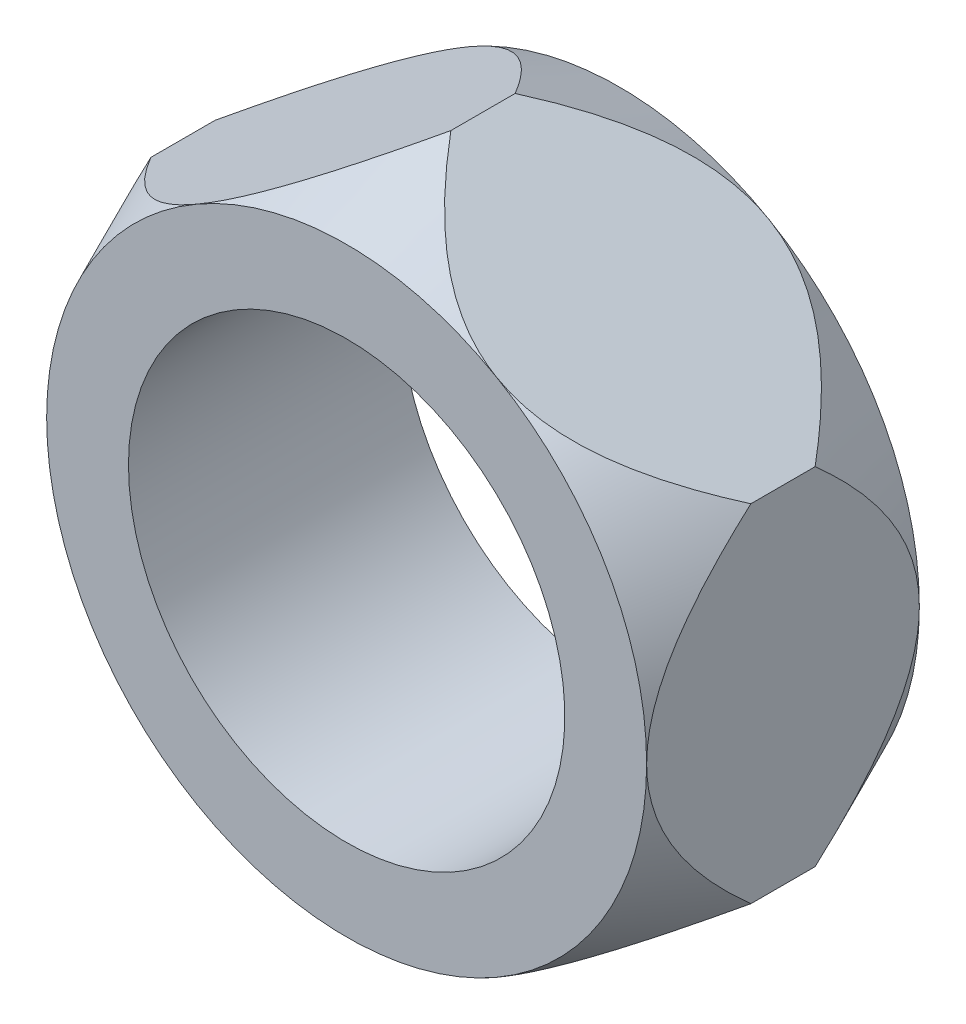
ISO-10303-21;
HEADER;
FILE_DESCRIPTION(('STEP AP214'),'2;1');
FILE_NAME('part.step','',(''),(''),'','','');
FILE_SCHEMA(('AUTOMOTIVE_DESIGN { 1 0 10303 214 1 1 1 1 }'));
ENDSEC;
DATA;
#1=APPLICATION_CONTEXT('core data for automotive mechanical design processes');
#2=APPLICATION_PROTOCOL_DEFINITION('international standard','automotive_design',2000,#1);
#3=PRODUCT_CONTEXT('',#1,'mechanical');
#4=PRODUCT('Part','Part','',(#3));
#5=PRODUCT_RELATED_PRODUCT_CATEGORY('part','',(#4));
#6=PRODUCT_DEFINITION_FORMATION('','',#4);
#7=PRODUCT_DEFINITION_CONTEXT('part definition',#1,'design');
#8=PRODUCT_DEFINITION('design','',#6,#7);
#9=PRODUCT_DEFINITION_SHAPE('','',#8);
#10=(LENGTH_UNIT() NAMED_UNIT(*) SI_UNIT(.MILLI.,.METRE.));
#11=(NAMED_UNIT(*) PLANE_ANGLE_UNIT() SI_UNIT($,.RADIAN.));
#12=(NAMED_UNIT(*) SI_UNIT($,.STERADIAN.) SOLID_ANGLE_UNIT());
#13=UNCERTAINTY_MEASURE_WITH_UNIT(LENGTH_MEASURE(1.E-05),#10,'distance_accuracy_value','');
#14=(GEOMETRIC_REPRESENTATION_CONTEXT(3) GLOBAL_UNCERTAINTY_ASSIGNED_CONTEXT((#13)) GLOBAL_UNIT_ASSIGNED_CONTEXT((#10,
#11,#12)) REPRESENTATION_CONTEXT('',''));
#15=CARTESIAN_POINT('',(0.,0.,0.));
#16=DIRECTION('',(0.,0.,1.));
#17=DIRECTION('',(1.,0.,0.));
#18=AXIS2_PLACEMENT_3D('',#15,#16,#17);
#19=CARTESIAN_POINT('',(2.75,1.58771324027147,2.5));
#20=DIRECTION('',(-0.5,-0.866025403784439,0.));
#21=DIRECTION('',(0.866025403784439,-0.5,0.));
#22=AXIS2_PLACEMENT_3D('',#19,#20,#21);
#23=PLANE('',#22);
#24=DIRECTION('',(0.,0.,-1.));
#25=VECTOR('',#24,1.);
#26=CARTESIAN_POINT('',(0.,3.17542648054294,2.5));
#27=LINE('',#26,#25);
#28=CARTESIAN_POINT('',(0.,3.17542648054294,1.54447648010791));
#29=VERTEX_POINT('',#28);
#30=CARTESIAN_POINT('',(0.,3.17542648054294,0.955523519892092));
#31=VERTEX_POINT('',#30);
#32=EDGE_CURVE('E275',#29,#31,#27,.T.);
#33=ORIENTED_EDGE('',*,*,#32,.F.);
#34=CARTESIAN_POINT('',(-0.0002,3.17554195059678,1.54421711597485));
#35=CARTESIAN_POINT('',(0.0266212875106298,3.1600566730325,1.57899726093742));
#36=CARTESIAN_POINT('',(0.0537667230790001,3.14438424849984,1.61344361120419));
#37=CARTESIAN_POINT('',(0.108791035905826,3.11261594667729,1.68156409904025));
#38=CARTESIAN_POINT('',(0.136670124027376,3.09651994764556,1.71523800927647));
#39=CARTESIAN_POINT('',(0.22191580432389,3.04730333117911,1.81538834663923));
#40=CARTESIAN_POINT('',(0.280510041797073,3.01347393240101,1.88049328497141));
#41=CARTESIAN_POINT('',(0.403820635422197,2.94228052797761,2.00785169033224));
#42=CARTESIAN_POINT('',(0.468680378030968,2.90483373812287,2.06992228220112));
#43=CARTESIAN_POINT('',(0.603403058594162,2.82705156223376,2.18600189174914));
#44=CARTESIAN_POINT('',(0.673249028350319,2.78672597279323,2.24003648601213));
#45=CARTESIAN_POINT('',(0.806569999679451,2.70975307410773,2.32831230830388));
#46=CARTESIAN_POINT('',(0.869132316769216,2.67363270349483,2.36435483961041));
#47=CARTESIAN_POINT('',(0.997832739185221,2.59932747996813,2.42515389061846));
#48=CARTESIAN_POINT('',(1.06394123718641,2.56115972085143,2.44999128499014));
#49=CARTESIAN_POINT('',(1.2000689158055,2.48256636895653,2.48587433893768));
#50=CARTESIAN_POINT('',(1.27013170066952,2.44211560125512,2.49670889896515));
#51=CARTESIAN_POINT('',(1.41078193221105,2.36091115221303,2.50199175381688));
#52=CARTESIAN_POINT('',(1.48136960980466,2.32015733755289,2.49643235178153));
#53=CARTESIAN_POINT('',(1.61084145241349,2.2454067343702,2.4717475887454));
#54=CARTESIAN_POINT('',(1.67001897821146,2.21124057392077,2.45455526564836));
#55=CARTESIAN_POINT('',(1.78562521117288,2.1444952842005,2.41061958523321));
#56=CARTESIAN_POINT('',(1.84205183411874,2.11191735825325,2.38386911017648));
#57=CARTESIAN_POINT('',(1.99746131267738,2.02219165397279,2.29762156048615));
#58=CARTESIAN_POINT('',(2.09276180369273,1.96716988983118,2.22940335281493));
#59=CARTESIAN_POINT('',(2.27427778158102,1.86237159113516,2.07812935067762));
#60=CARTESIAN_POINT('',(2.36044188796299,1.81262472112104,1.99499606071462));
#61=CARTESIAN_POINT('',(2.4972367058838,1.73364619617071,1.84980094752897));
#62=CARTESIAN_POINT('',(2.54993025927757,1.70322355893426,1.79027383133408));
#63=CARTESIAN_POINT('',(2.65214532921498,1.64420966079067,1.66889001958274));
#64=CARTESIAN_POINT('',(2.7016942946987,1.61560255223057,1.60706426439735));
#65=CARTESIAN_POINT('',(2.7502,1.58759777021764,1.54421711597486));
#66=B_SPLINE_CURVE_WITH_KNOTS('',3,(#34,#35,#36,#37,#38,#39,#40,#41,#42,#43,#44,#45,#46,#47,#48,
#49,#50,#51,#52,#53,#54,#55,#56,#57,#58,#59,#60,#61,#62,#63,#64,#65),.UNSPECIFIED.,.F.,.F.,(4,2,
2,2,2,2,2,2,2,2,2,2,2,2,2,4),(0.,0.139706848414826,0.279454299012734,0.560944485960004,
0.85241248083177,1.14293198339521,1.38444638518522,1.62418858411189,1.86750440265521,
2.11093447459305,2.32149642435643,2.5322155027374,2.91837299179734,3.30659825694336,
3.56186037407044,3.8144481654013),.UNSPECIFIED.);
#67=CARTESIAN_POINT('',(1.375,2.38156986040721,2.5));
#68=VERTEX_POINT('',#67);
#69=EDGE_CURVE('E338',#29,#68,#66,.T.);
#70=ORIENTED_EDGE('',*,*,#69,.T.);
#71=CARTESIAN_POINT('',(2.75,1.58771324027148,1.5444764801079));
#72=VERTEX_POINT('',#71);
#73=EDGE_CURVE('E139',#68,#72,#66,.T.);
#74=ORIENTED_EDGE('',*,*,#73,.T.);
#75=DIRECTION('',(0.,0.,-1.));
#76=VECTOR('',#75,1.);
#77=CARTESIAN_POINT('',(2.75,1.58771324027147,2.5));
#78=LINE('',#77,#76);
#79=CARTESIAN_POINT('',(2.75,1.58771324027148,0.955523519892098));
#80=VERTEX_POINT('',#79);
#81=EDGE_CURVE('E150',#72,#80,#78,.T.);
#82=ORIENTED_EDGE('',*,*,#81,.T.);
#83=CARTESIAN_POINT('',(-0.0002,3.17554195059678,0.955782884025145));
#84=CARTESIAN_POINT('',(0.0266212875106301,3.1600566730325,0.921002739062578));
#85=CARTESIAN_POINT('',(0.0537667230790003,3.14438424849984,0.886556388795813));
#86=CARTESIAN_POINT('',(0.108791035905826,3.11261594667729,0.81843590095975));
#87=CARTESIAN_POINT('',(0.136670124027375,3.09651994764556,0.784761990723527));
#88=CARTESIAN_POINT('',(0.22191580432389,3.04730333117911,0.684611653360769));
#89=CARTESIAN_POINT('',(0.280510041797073,3.01347393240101,0.61950671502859));
#90=CARTESIAN_POINT('',(0.403820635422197,2.94228052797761,0.492148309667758));
#91=CARTESIAN_POINT('',(0.468680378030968,2.90483373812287,0.430077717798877));
#92=CARTESIAN_POINT('',(0.603403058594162,2.82705156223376,0.313998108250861));
#93=CARTESIAN_POINT('',(0.673249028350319,2.78672597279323,0.259963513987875));
#94=CARTESIAN_POINT('',(0.806569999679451,2.70975307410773,0.171687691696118));
#95=CARTESIAN_POINT('',(0.869132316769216,2.67363270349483,0.135645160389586));
#96=CARTESIAN_POINT('',(0.997832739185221,2.59932747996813,0.0748461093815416));
#97=CARTESIAN_POINT('',(1.06394123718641,2.56115972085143,0.0500087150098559));
#98=CARTESIAN_POINT('',(1.2000689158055,2.48256636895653,0.0141256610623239));
#99=CARTESIAN_POINT('',(1.27013170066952,2.44211560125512,0.00329110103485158));
#100=CARTESIAN_POINT('',(1.41078193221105,2.36091115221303,-0.00199175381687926));
#101=CARTESIAN_POINT('',(1.48136960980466,2.32015733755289,0.00356764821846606));
#102=CARTESIAN_POINT('',(1.6108414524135,2.2454067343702,0.0282524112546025));
#103=CARTESIAN_POINT('',(1.67001897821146,2.21124057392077,0.0454447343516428));
#104=CARTESIAN_POINT('',(1.78562521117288,2.1444952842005,0.0893804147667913));
#105=CARTESIAN_POINT('',(1.84205183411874,2.11191735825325,0.116130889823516));
#106=CARTESIAN_POINT('',(1.99746131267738,2.02219165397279,0.202378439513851));
#107=CARTESIAN_POINT('',(2.09276180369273,1.96716988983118,0.270596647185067));
#108=CARTESIAN_POINT('',(2.27427778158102,1.86237159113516,0.421870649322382));
#109=CARTESIAN_POINT('',(2.36044188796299,1.81262472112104,0.50500393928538));
#110=CARTESIAN_POINT('',(2.49723670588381,1.73364619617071,0.650199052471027));
#111=CARTESIAN_POINT('',(2.54993025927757,1.70322355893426,0.709726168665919));
#112=CARTESIAN_POINT('',(2.65214532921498,1.64420966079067,0.831109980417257));
#113=CARTESIAN_POINT('',(2.7016942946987,1.61560255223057,0.892935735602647));
#114=CARTESIAN_POINT('',(2.7502,1.58759777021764,0.955782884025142));
#115=B_SPLINE_CURVE_WITH_KNOTS('',3,(#83,#84,#85,#86,#87,#88,#89,#90,#91,#92,#93,#94,#95,#96,
#97,#98,#99,#100,#101,#102,#103,#104,#105,#106,#107,#108,#109,#110,#111,#112,#113,#114),
.UNSPECIFIED.,.F.,.F.,(4,2,2,2,2,2,2,2,2,2,2,2,2,2,2,4),(0.,0.139706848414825,0.279454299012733,
0.560944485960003,0.85241248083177,1.14293198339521,1.38444638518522,1.62418858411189,
1.86750440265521,2.11093447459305,2.32149642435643,2.5322155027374,2.91837299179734,
3.30659825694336,3.56186037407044,3.8144481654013),.UNSPECIFIED.);
#116=CARTESIAN_POINT('',(1.375,2.38156986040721,0.));
#117=VERTEX_POINT('',#116);
#118=EDGE_CURVE('E213',#117,#80,#115,.T.);
#119=ORIENTED_EDGE('',*,*,#118,.F.);
#120=EDGE_CURVE('E317',#31,#117,#115,.T.);
#121=ORIENTED_EDGE('',*,*,#120,.F.);
#122=EDGE_LOOP('',(#33,#70,#74,#82,#119,#121));
#123=FACE_BOUND('',#122,.T.);
#124=ADVANCED_FACE('F32',(#123),#23,.F.);
#125=CARTESIAN_POINT('',(0.,3.17542648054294,2.5));
#126=DIRECTION('',(0.499999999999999,-0.866025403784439,0.));
#127=DIRECTION('',(0.866025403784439,0.499999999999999,0.));
#128=AXIS2_PLACEMENT_3D('',#125,#126,#127);
#129=PLANE('',#128);
#130=DIRECTION('',(0.,0.,-1.));
#131=VECTOR('',#130,1.);
#132=CARTESIAN_POINT('',(-2.75,1.58771324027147,2.5));
#133=LINE('',#132,#131);
#134=CARTESIAN_POINT('',(-2.75,1.58771324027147,1.5444764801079));
#135=VERTEX_POINT('',#134);
#136=CARTESIAN_POINT('',(-2.75,1.58771324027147,0.955523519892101));
#137=VERTEX_POINT('',#136);
#138=EDGE_CURVE('E269',#135,#137,#133,.T.);
#139=ORIENTED_EDGE('',*,*,#138,.F.);
#140=CARTESIAN_POINT('',(-2.7502,1.58759777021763,1.54421711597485));
#141=CARTESIAN_POINT('',(-2.72337871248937,1.60308304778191,1.57899726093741));
#142=CARTESIAN_POINT('',(-2.696233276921,1.61875547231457,1.61344361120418));
#143=CARTESIAN_POINT('',(-2.64120896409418,1.65052377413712,1.68156409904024));
#144=CARTESIAN_POINT('',(-2.61332987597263,1.66661977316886,1.71523800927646));
#145=CARTESIAN_POINT('',(-2.52808419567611,1.7158363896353,1.81538834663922));
#146=CARTESIAN_POINT('',(-2.46948995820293,1.7496657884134,1.8804932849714));
#147=CARTESIAN_POINT('',(-2.34617936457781,1.8208591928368,2.00785169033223));
#148=CARTESIAN_POINT('',(-2.28131962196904,1.85830598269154,2.06992228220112));
#149=CARTESIAN_POINT('',(-2.14659694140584,1.93608815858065,2.18600189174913));
#150=CARTESIAN_POINT('',(-2.07675097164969,1.97641374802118,2.24003648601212));
#151=CARTESIAN_POINT('',(-1.94343000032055,2.05338664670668,2.32831230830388));
#152=CARTESIAN_POINT('',(-1.88086768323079,2.08950701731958,2.36435483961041));
#153=CARTESIAN_POINT('',(-1.75216726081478,2.16381224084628,2.42515389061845));
#154=CARTESIAN_POINT('',(-1.6860587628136,2.20197999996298,2.44999128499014));
#155=CARTESIAN_POINT('',(-1.5499310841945,2.28057335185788,2.48587433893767));
#156=CARTESIAN_POINT('',(-1.47986829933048,2.32102411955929,2.49670889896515));
#157=CARTESIAN_POINT('',(-1.33921806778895,2.40222856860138,2.50199175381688));
#158=CARTESIAN_POINT('',(-1.26863039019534,2.44298238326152,2.49643235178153));
#159=CARTESIAN_POINT('',(-1.13915854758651,2.51773298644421,2.4717475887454));
#160=CARTESIAN_POINT('',(-1.07998102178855,2.55189914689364,2.45455526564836));
#161=CARTESIAN_POINT('',(-0.964374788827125,2.61864443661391,2.41061958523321));
#162=CARTESIAN_POINT('',(-0.907948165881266,2.65122236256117,2.38386911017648));
#163=CARTESIAN_POINT('',(-0.752538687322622,2.74094806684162,2.29762156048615));
#164=CARTESIAN_POINT('',(-0.657238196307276,2.79596983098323,2.22940335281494));
#165=CARTESIAN_POINT('',(-0.475722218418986,2.90076812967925,2.07812935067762));
#166=CARTESIAN_POINT('',(-0.389558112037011,2.95051499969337,1.99499606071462));
#167=CARTESIAN_POINT('',(-0.252763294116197,3.0294935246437,1.84980094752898));
#168=CARTESIAN_POINT('',(-0.200069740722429,3.05991616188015,1.79027383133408));
#169=CARTESIAN_POINT('',(-0.0978546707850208,3.11893006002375,1.66889001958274));
#170=CARTESIAN_POINT('',(-0.0483057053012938,3.14753716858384,1.60706426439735));
#171=CARTESIAN_POINT('',(0.000199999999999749,3.17554195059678,1.54421711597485));
#172=B_SPLINE_CURVE_WITH_KNOTS('',3,(#140,#141,#142,#143,#144,#145,#146,#147,#148,#149,#150,
#151,#152,#153,#154,#155,#156,#157,#158,#159,#160,#161,#162,#163,#164,#165,#166,#167,#168,#169,
#170,#171),.UNSPECIFIED.,.F.,.F.,(4,2,2,2,2,2,2,2,2,2,2,2,2,2,2,4),(0.,0.139706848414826,
0.279454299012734,0.560944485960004,0.852412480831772,1.14293198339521,1.38444638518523,
1.6241885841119,1.86750440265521,2.11093447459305,2.32149642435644,2.53221550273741,
2.91837299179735,3.30659825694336,3.56186037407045,3.81444816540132),.UNSPECIFIED.);
#173=CARTESIAN_POINT('',(-1.375,2.38156986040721,2.5));
#174=VERTEX_POINT('',#173);
#175=EDGE_CURVE('E250',#135,#174,#172,.T.);
#176=ORIENTED_EDGE('',*,*,#175,.T.);
#177=EDGE_CURVE('E242',#174,#29,#172,.T.);
#178=ORIENTED_EDGE('',*,*,#177,.T.);
#179=ORIENTED_EDGE('',*,*,#32,.T.);
#180=CARTESIAN_POINT('',(-2.7502,1.58759777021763,0.955782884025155));
#181=CARTESIAN_POINT('',(-2.72337871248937,1.60308304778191,0.921002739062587));
#182=CARTESIAN_POINT('',(-2.696233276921,1.61875547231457,0.886556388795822));
#183=CARTESIAN_POINT('',(-2.64120896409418,1.65052377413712,0.818435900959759));
#184=CARTESIAN_POINT('',(-2.61332987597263,1.66661977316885,0.784761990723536));
#185=CARTESIAN_POINT('',(-2.52808419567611,1.7158363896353,0.684611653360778));
#186=CARTESIAN_POINT('',(-2.46948995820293,1.7496657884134,0.619506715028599));
#187=CARTESIAN_POINT('',(-2.34617936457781,1.8208591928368,0.492148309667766));
#188=CARTESIAN_POINT('',(-2.28131962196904,1.85830598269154,0.430077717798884));
#189=CARTESIAN_POINT('',(-2.14659694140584,1.93608815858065,0.313998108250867));
#190=CARTESIAN_POINT('',(-2.07675097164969,1.97641374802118,0.259963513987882));
#191=CARTESIAN_POINT('',(-1.94343000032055,2.05338664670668,0.171687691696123));
#192=CARTESIAN_POINT('',(-1.88086768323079,2.08950701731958,0.135645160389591));
#193=CARTESIAN_POINT('',(-1.75216726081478,2.16381224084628,0.0748461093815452));
#194=CARTESIAN_POINT('',(-1.6860587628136,2.20197999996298,0.0500087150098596));
#195=CARTESIAN_POINT('',(-1.5499310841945,2.28057335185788,0.0141256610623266));
#196=CARTESIAN_POINT('',(-1.47986829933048,2.32102411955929,0.00329110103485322));
#197=CARTESIAN_POINT('',(-1.33921806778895,2.40222856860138,-0.00199175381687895));
#198=CARTESIAN_POINT('',(-1.26863039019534,2.44298238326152,0.00356764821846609));
#199=CARTESIAN_POINT('',(-1.13915854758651,2.51773298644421,0.0282524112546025));
#200=CARTESIAN_POINT('',(-1.07998102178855,2.55189914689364,0.045444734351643));
#201=CARTESIAN_POINT('',(-0.964374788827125,2.61864443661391,0.0893804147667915));
#202=CARTESIAN_POINT('',(-0.907948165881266,2.65122236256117,0.116130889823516));
#203=CARTESIAN_POINT('',(-0.752538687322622,2.74094806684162,0.20237843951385));
#204=CARTESIAN_POINT('',(-0.657238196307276,2.79596983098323,0.270596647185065));
#205=CARTESIAN_POINT('',(-0.475722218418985,2.90076812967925,0.421870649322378));
#206=CARTESIAN_POINT('',(-0.38955811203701,2.95051499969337,0.505003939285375));
#207=CARTESIAN_POINT('',(-0.252763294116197,3.0294935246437,0.650199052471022));
#208=CARTESIAN_POINT('',(-0.200069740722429,3.05991616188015,0.709726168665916));
#209=CARTESIAN_POINT('',(-0.0978546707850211,3.11893006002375,0.831109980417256));
#210=CARTESIAN_POINT('',(-0.0483057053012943,3.14753716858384,0.892935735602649));
#211=CARTESIAN_POINT('',(0.000199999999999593,3.17554195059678,0.955782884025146));
#212=B_SPLINE_CURVE_WITH_KNOTS('',3,(#180,#181,#182,#183,#184,#185,#186,#187,#188,#189,#190,
#191,#192,#193,#194,#195,#196,#197,#198,#199,#200,#201,#202,#203,#204,#205,#206,#207,#208,#209,
#210,#211),.UNSPECIFIED.,.F.,.F.,(4,2,2,2,2,2,2,2,2,2,2,2,2,2,2,4),(0.,0.139706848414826,
0.279454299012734,0.560944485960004,0.852412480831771,1.14293198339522,1.38444638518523,
1.6241885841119,1.86750440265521,2.11093447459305,2.32149642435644,2.53221550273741,
2.91837299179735,3.30659825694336,3.56186037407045,3.81444816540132),.UNSPECIFIED.);
#213=CARTESIAN_POINT('',(-1.375,2.38156986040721,0.));
#214=VERTEX_POINT('',#213);
#215=EDGE_CURVE('E222',#214,#31,#212,.T.);
#216=ORIENTED_EDGE('',*,*,#215,.F.);
#217=EDGE_CURVE('E271',#137,#214,#212,.T.);
#218=ORIENTED_EDGE('',*,*,#217,.F.);
#219=EDGE_LOOP('',(#139,#176,#178,#179,#216,#218));
#220=FACE_BOUND('',#219,.T.);
#221=ADVANCED_FACE('F255',(#220),#129,.F.);
#222=CARTESIAN_POINT('',(-2.75,1.58771324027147,2.5));
#223=DIRECTION('',(1.,0.,0.));
#224=DIRECTION('',(0.,1.,0.));
#225=AXIS2_PLACEMENT_3D('',#222,#223,#224);
#226=PLANE('',#225);
#227=DIRECTION('',(0.,0.,-1.));
#228=VECTOR('',#227,1.);
#229=CARTESIAN_POINT('',(-2.75000000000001,-1.58771324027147,2.5));
#230=LINE('',#229,#228);
#231=CARTESIAN_POINT('',(-2.75000000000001,-1.58771324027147,1.54447648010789));
#232=VERTEX_POINT('',#231);
#233=CARTESIAN_POINT('',(-2.75000000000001,-1.58771324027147,0.955523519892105));
#234=VERTEX_POINT('',#233);
#235=EDGE_CURVE('E276',#232,#234,#230,.T.);
#236=ORIENTED_EDGE('',*,*,#235,.F.);
#237=CARTESIAN_POINT('',(-2.75000000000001,-2.92404370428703,-0.339084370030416));
#238=CARTESIAN_POINT('',(-2.75000000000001,-2.86528718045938,-0.242973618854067));
#239=CARTESIAN_POINT('',(-2.75000000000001,-2.80594274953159,-0.147216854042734));
#240=CARTESIAN_POINT('',(-2.75000000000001,-2.68582170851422,0.0434276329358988));
#241=CARTESIAN_POINT('',(-2.75000000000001,-2.62504473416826,0.138315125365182));
#242=CARTESIAN_POINT('',(-2.75000000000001,-2.50119688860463,0.32798335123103));
#243=CARTESIAN_POINT('',(-2.75000000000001,-2.43810882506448,0.422752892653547));
#244=CARTESIAN_POINT('',(-2.75000000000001,-2.30991505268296,0.610904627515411));
#245=CARTESIAN_POINT('',(-2.75000000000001,-2.24480958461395,0.704286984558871));
#246=CARTESIAN_POINT('',(-2.75000000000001,-2.10688308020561,0.896651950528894));
#247=CARTESIAN_POINT('',(-2.75000000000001,-2.03385992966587,0.995490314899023));
#248=CARTESIAN_POINT('',(-2.75000000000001,-1.88426620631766,1.19044123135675));
#249=CARTESIAN_POINT('',(-2.75000000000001,-1.80769618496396,1.28655420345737));
#250=CARTESIAN_POINT('',(-2.75000000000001,-1.65037222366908,1.47462627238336));
#251=CARTESIAN_POINT('',(-2.75000000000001,-1.56963734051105,1.56660121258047));
#252=CARTESIAN_POINT('',(-2.75000000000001,-1.40243819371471,1.74514633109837));
#253=CARTESIAN_POINT('',(-2.75000000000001,-1.31597932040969,1.83172144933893));
#254=CARTESIAN_POINT('',(-2.75000000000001,-1.18097732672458,1.95515104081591));
#255=CARTESIAN_POINT('',(-2.75000000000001,-1.13526019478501,1.99509338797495));
#256=CARTESIAN_POINT('',(-2.75000000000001,-1.04168501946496,2.07244718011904));
#257=CARTESIAN_POINT('',(-2.75000000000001,-0.993826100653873,2.10985757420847));
#258=CARTESIAN_POINT('',(-2.75000000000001,-0.896115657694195,2.18116261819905));
#259=CARTESIAN_POINT('',(-2.75000000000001,-0.846282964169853,2.21508281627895));
#260=CARTESIAN_POINT('',(-2.75000000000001,-0.744092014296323,2.27883949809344));
#261=CARTESIAN_POINT('',(-2.75000000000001,-0.69173516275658,2.30867821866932));
#262=CARTESIAN_POINT('',(-2.75000000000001,-0.568216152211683,2.37137554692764));
#263=CARTESIAN_POINT('',(-2.75000000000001,-0.496122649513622,2.40245684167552));
#264=CARTESIAN_POINT('',(-2.75000000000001,-0.347922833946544,2.45292556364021));
#265=CARTESIAN_POINT('',(-2.75,-0.271821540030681,2.47232725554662));
#266=CARTESIAN_POINT('',(-2.75,-0.116505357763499,2.49692035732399));
#267=CARTESIAN_POINT('',(-2.75,-0.0372676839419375,2.50197436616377));
#268=CARTESIAN_POINT('',(-2.75,0.120669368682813,2.49660543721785));
#269=CARTESIAN_POINT('',(-2.75,0.199368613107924,2.48617876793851));
#270=CARTESIAN_POINT('',(-2.75,0.362793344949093,2.44947913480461));
#271=CARTESIAN_POINT('',(-2.75,0.447112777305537,2.42145898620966));
#272=CARTESIAN_POINT('',(-2.75,0.610210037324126,2.35234689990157));
#273=CARTESIAN_POINT('',(-2.75,0.688974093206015,2.3112237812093));
#274=CARTESIAN_POINT('',(-2.75,0.833663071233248,2.22413652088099));
#275=CARTESIAN_POINT('',(-2.75,0.900097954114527,2.17899681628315));
#276=CARTESIAN_POINT('',(-2.75,1.02892935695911,2.0832313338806));
#277=CARTESIAN_POINT('',(-2.75,1.09132205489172,2.03260048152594));
#278=CARTESIAN_POINT('',(-2.75,1.21315766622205,1.92687100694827));
#279=CARTESIAN_POINT('',(-2.75,1.2725685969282,1.87173594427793));
#280=CARTESIAN_POINT('',(-2.75,1.38836609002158,1.7584622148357));
#281=CARTESIAN_POINT('',(-2.75,1.44475429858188,1.70032521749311));
#282=CARTESIAN_POINT('',(-2.75,1.55854733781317,1.57794623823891));
#283=CARTESIAN_POINT('',(-2.75,1.61578701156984,1.51355150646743));
#284=CARTESIAN_POINT('',(-2.75,1.72790436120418,1.3827315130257));
#285=CARTESIAN_POINT('',(-2.75,1.78278164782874,1.31630591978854));
#286=CARTESIAN_POINT('',(-2.75,1.94452184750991,1.11456666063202));
#287=CARTESIAN_POINT('',(-2.75,2.04841635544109,0.976875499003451));
#288=CARTESIAN_POINT('',(-2.75,2.25083597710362,0.696871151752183));
#289=CARTESIAN_POINT('',(-2.75,2.34933935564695,0.554542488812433));
#290=CARTESIAN_POINT('',(-2.75,2.54200725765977,0.266963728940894));
#291=CARTESIAN_POINT('',(-2.75,2.6361712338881,0.121713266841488));
#292=CARTESIAN_POINT('',(-2.75,2.8129205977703,-0.157908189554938));
#293=CARTESIAN_POINT('',(-2.75,2.89579155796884,-0.292099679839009));
#294=CARTESIAN_POINT('',(-2.75,3.05928603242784,-0.561863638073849));
#295=CARTESIAN_POINT('',(-2.75,3.13990928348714,-0.697436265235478));
#296=CARTESIAN_POINT('',(-2.75,3.29861152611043,-0.968472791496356));
#297=CARTESIAN_POINT('',(-2.75,3.37670658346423,-1.10392730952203));
#298=CARTESIAN_POINT('',(-2.75,3.53135284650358,-1.37567848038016));
#299=CARTESIAN_POINT('',(-2.75,3.60790436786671,-1.51197495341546));
#300=CARTESIAN_POINT('',(-2.75,3.68383645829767,-1.64861119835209));
#301=B_SPLINE_CURVE_WITH_KNOTS('',3,(#237,#238,#239,#240,#241,#242,#243,#244,#245,#246,#247,
#248,#249,#250,#251,#252,#253,#254,#255,#256,#257,#258,#259,#260,#261,#262,#263,#264,#265,#266,
#267,#268,#269,#270,#271,#272,#273,#274,#275,#276,#277,#278,#279,#280,#281,#282,#283,#284,#285,
#286,#287,#288,#289,#290,#291,#292,#293,#294,#295,#296,#297,#298,#299,#300),.UNSPECIFIED.,.F.,
.F.,(4,2,2,2,2,2,2,2,2,2,2,2,2,2,2,2,2,2,2,2,2,2,2,2,2,2,2,2,2,2,2,4),(0.,0.33794923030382,
0.675985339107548,1.01750744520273,1.35898894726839,1.72759105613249,2.09613604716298,
2.46312295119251,2.82976904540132,3.01182236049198,3.19395077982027,3.37463361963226,
3.55521703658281,3.78994870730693,4.0243931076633,4.26107521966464,4.49781439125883,
4.76288729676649,5.02859576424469,5.26920066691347,5.51002984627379,5.75304897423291,
5.99593438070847,6.25433522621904,6.51277848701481,7.03000791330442,7.54918863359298,
8.06843464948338,8.54156337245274,9.01474726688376,9.48380070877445,9.9527572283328),.UNSPECIFIED.);
#302=CARTESIAN_POINT('',(-2.75,0.,2.5));
#303=VERTEX_POINT('',#302);
#304=EDGE_CURVE('E487',#232,#303,#301,.T.);
#305=ORIENTED_EDGE('',*,*,#304,.T.);
#306=EDGE_CURVE('E251',#303,#135,#301,.T.);
#307=ORIENTED_EDGE('',*,*,#306,.T.);
#308=ORIENTED_EDGE('',*,*,#138,.T.);
#309=CARTESIAN_POINT('',(-2.75000000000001,-2.92404370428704,2.83908437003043));
#310=CARTESIAN_POINT('',(-2.75000000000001,-2.86528718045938,2.74297361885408));
#311=CARTESIAN_POINT('',(-2.75000000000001,-2.8059427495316,2.64721685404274));
#312=CARTESIAN_POINT('',(-2.75000000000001,-2.68582170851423,2.45657236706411));
#313=CARTESIAN_POINT('',(-2.75000000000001,-2.62504473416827,2.36168487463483));
#314=CARTESIAN_POINT('',(-2.75000000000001,-2.50119688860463,2.17201664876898));
#315=CARTESIAN_POINT('',(-2.75000000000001,-2.43810882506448,2.07724710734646));
#316=CARTESIAN_POINT('',(-2.75000000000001,-2.30991505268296,1.88909537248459));
#317=CARTESIAN_POINT('',(-2.75000000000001,-2.24480958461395,1.79571301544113));
#318=CARTESIAN_POINT('',(-2.75000000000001,-2.10688308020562,1.60334804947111));
#319=CARTESIAN_POINT('',(-2.75000000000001,-2.03385992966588,1.50450968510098));
#320=CARTESIAN_POINT('',(-2.75000000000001,-1.88426620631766,1.30955876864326));
#321=CARTESIAN_POINT('',(-2.75000000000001,-1.80769618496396,1.21344579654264));
#322=CARTESIAN_POINT('',(-2.75000000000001,-1.65037222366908,1.02537372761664));
#323=CARTESIAN_POINT('',(-2.75000000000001,-1.56963734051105,0.93339878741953));
#324=CARTESIAN_POINT('',(-2.75000000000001,-1.40243819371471,0.754853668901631));
#325=CARTESIAN_POINT('',(-2.75000000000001,-1.31597932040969,0.668278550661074));
#326=CARTESIAN_POINT('',(-2.75000000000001,-1.18097732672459,0.544848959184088));
#327=CARTESIAN_POINT('',(-2.75000000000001,-1.13526019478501,0.504906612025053));
#328=CARTESIAN_POINT('',(-2.75000000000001,-1.04168501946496,0.427552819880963));
#329=CARTESIAN_POINT('',(-2.75000000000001,-0.993826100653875,0.390142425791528));
#330=CARTESIAN_POINT('',(-2.75000000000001,-0.896115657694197,0.318837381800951));
#331=CARTESIAN_POINT('',(-2.75000000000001,-0.846282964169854,0.284917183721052));
#332=CARTESIAN_POINT('',(-2.75000000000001,-0.744092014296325,0.221160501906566));
#333=CARTESIAN_POINT('',(-2.75000000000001,-0.691735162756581,0.191321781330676));
#334=CARTESIAN_POINT('',(-2.75000000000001,-0.568216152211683,0.128624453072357));
#335=CARTESIAN_POINT('',(-2.75000000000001,-0.496122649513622,0.0975431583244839));
#336=CARTESIAN_POINT('',(-2.75000000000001,-0.347922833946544,0.0470744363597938));
#337=CARTESIAN_POINT('',(-2.75,-0.271821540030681,0.02767274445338));
#338=CARTESIAN_POINT('',(-2.75,-0.116505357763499,0.00307964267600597));
#339=CARTESIAN_POINT('',(-2.75,-0.0372676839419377,-0.00197436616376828));
#340=CARTESIAN_POINT('',(-2.75,0.120669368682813,0.00339456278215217));
#341=CARTESIAN_POINT('',(-2.75,0.199368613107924,0.0138212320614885));
#342=CARTESIAN_POINT('',(-2.75,0.362793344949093,0.0505208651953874));
#343=CARTESIAN_POINT('',(-2.75,0.447112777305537,0.0785410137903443));
#344=CARTESIAN_POINT('',(-2.75,0.610210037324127,0.147653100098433));
#345=CARTESIAN_POINT('',(-2.75,0.688974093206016,0.1887762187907));
#346=CARTESIAN_POINT('',(-2.75,0.833663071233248,0.275863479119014));
#347=CARTESIAN_POINT('',(-2.75,0.900097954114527,0.321003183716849));
#348=CARTESIAN_POINT('',(-2.75,1.02892935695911,0.416768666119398));
#349=CARTESIAN_POINT('',(-2.75,1.09132205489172,0.467399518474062));
#350=CARTESIAN_POINT('',(-2.75,1.21315766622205,0.573128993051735));
#351=CARTESIAN_POINT('',(-2.75,1.2725685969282,0.628264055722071));
#352=CARTESIAN_POINT('',(-2.75,1.38836609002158,0.741537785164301));
#353=CARTESIAN_POINT('',(-2.75,1.44475429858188,0.799674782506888));
#354=CARTESIAN_POINT('',(-2.75,1.55854733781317,0.922053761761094));
#355=CARTESIAN_POINT('',(-2.75,1.61578701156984,0.986448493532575));
#356=CARTESIAN_POINT('',(-2.75,1.72790436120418,1.1172684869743));
#357=CARTESIAN_POINT('',(-2.75,1.78278164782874,1.18369408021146));
#358=CARTESIAN_POINT('',(-2.75,1.94452184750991,1.38543333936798));
#359=CARTESIAN_POINT('',(-2.75,2.04841635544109,1.52312450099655));
#360=CARTESIAN_POINT('',(-2.75,2.25083597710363,1.80312884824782));
#361=CARTESIAN_POINT('',(-2.75,2.34933935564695,1.94545751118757));
#362=CARTESIAN_POINT('',(-2.75,2.54200725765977,2.23303627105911));
#363=CARTESIAN_POINT('',(-2.75,2.6361712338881,2.37828673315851));
#364=CARTESIAN_POINT('',(-2.75,2.8129205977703,2.65790818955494));
#365=CARTESIAN_POINT('',(-2.75,2.89579155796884,2.79209967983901));
#366=CARTESIAN_POINT('',(-2.75,3.05928603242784,3.06186363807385));
#367=CARTESIAN_POINT('',(-2.75,3.13990928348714,3.19743626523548));
#368=CARTESIAN_POINT('',(-2.75,3.29861152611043,3.46847279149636));
#369=CARTESIAN_POINT('',(-2.75,3.37670658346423,3.60392730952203));
#370=CARTESIAN_POINT('',(-2.75,3.53135284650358,3.87567848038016));
#371=CARTESIAN_POINT('',(-2.75,3.60790436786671,4.01197495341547));
#372=CARTESIAN_POINT('',(-2.75,3.68383645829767,4.14861119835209));
#373=B_SPLINE_CURVE_WITH_KNOTS('',3,(#309,#310,#311,#312,#313,#314,#315,#316,#317,#318,#319,
#320,#321,#322,#323,#324,#325,#326,#327,#328,#329,#330,#331,#332,#333,#334,#335,#336,#337,#338,
#339,#340,#341,#342,#343,#344,#345,#346,#347,#348,#349,#350,#351,#352,#353,#354,#355,#356,#357,
#358,#359,#360,#361,#362,#363,#364,#365,#366,#367,#368,#369,#370,#371,#372),.UNSPECIFIED.,.F.,
.F.,(4,2,2,2,2,2,2,2,2,2,2,2,2,2,2,2,2,2,2,2,2,2,2,2,2,2,2,2,2,2,2,4),(0.,0.337949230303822,
0.675985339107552,1.01750744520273,1.3589889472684,1.7275910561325,2.09613604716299,
2.46312295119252,2.82976904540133,3.01182236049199,3.19395077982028,3.37463361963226,
3.55521703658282,3.78994870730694,4.02439310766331,4.26107521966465,4.49781439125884,
4.7628872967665,5.0285957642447,5.26920066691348,5.5100298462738,5.75304897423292,
5.99593438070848,6.25433522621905,6.51277848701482,7.03000791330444,7.54918863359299,
8.0684346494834,8.54156337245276,9.01474726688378,9.48380070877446,9.95275722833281),.UNSPECIFIED.);
#374=CARTESIAN_POINT('',(-2.75,0.,0.));
#375=VERTEX_POINT('',#374);
#376=EDGE_CURVE('E203',#375,#137,#373,.T.);
#377=ORIENTED_EDGE('',*,*,#376,.F.);
#378=EDGE_CURVE('E305',#234,#375,#373,.T.);
#379=ORIENTED_EDGE('',*,*,#378,.F.);
#380=EDGE_LOOP('',(#236,#305,#307,#308,#377,#379));
#381=FACE_BOUND('',#380,.T.);
#382=ADVANCED_FACE('F231',(#381),#226,.F.);
#383=CARTESIAN_POINT('',(-2.75000000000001,-1.58771324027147,2.5));
#384=DIRECTION('',(0.500000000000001,0.866025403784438,0.));
#385=DIRECTION('',(-0.866025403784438,0.500000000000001,0.));
#386=AXIS2_PLACEMENT_3D('',#383,#384,#385);
#387=PLANE('',#386);
#388=DIRECTION('',(0.,0.,-1.));
#389=VECTOR('',#388,1.);
#390=CARTESIAN_POINT('',(0.,-3.17542648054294,2.5));
#391=LINE('',#390,#389);
#392=CARTESIAN_POINT('',(0.,-3.17542648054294,1.54447648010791));
#393=VERTEX_POINT('',#392);
#394=CARTESIAN_POINT('',(0.,-3.17542648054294,0.955523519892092));
#395=VERTEX_POINT('',#394);
#396=EDGE_CURVE('E280',#393,#395,#391,.T.);
#397=ORIENTED_EDGE('',*,*,#396,.F.);
#398=CARTESIAN_POINT('',(0.000199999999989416,-3.17554195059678,1.54421711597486));
#399=CARTESIAN_POINT('',(-0.0266212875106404,-3.1600566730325,1.57899726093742));
#400=CARTESIAN_POINT('',(-0.0537667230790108,-3.14438424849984,1.61344361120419));
#401=CARTESIAN_POINT('',(-0.108791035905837,-3.11261594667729,1.68156409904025));
#402=CARTESIAN_POINT('',(-0.136670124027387,-3.09651994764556,1.71523800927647));
#403=CARTESIAN_POINT('',(-0.221915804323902,-3.04730333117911,1.81538834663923));
#404=CARTESIAN_POINT('',(-0.280510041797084,-3.01347393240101,1.88049328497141));
#405=CARTESIAN_POINT('',(-0.403820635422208,-2.94228052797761,2.00785169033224));
#406=CARTESIAN_POINT('',(-0.46868037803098,-2.90483373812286,2.06992228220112));
#407=CARTESIAN_POINT('',(-0.603403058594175,-2.82705156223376,2.18600189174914));
#408=CARTESIAN_POINT('',(-0.673249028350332,-2.78672597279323,2.24003648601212));
#409=CARTESIAN_POINT('',(-0.806569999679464,-2.70975307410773,2.32831230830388));
#410=CARTESIAN_POINT('',(-0.869132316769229,-2.67363270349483,2.36435483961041));
#411=CARTESIAN_POINT('',(-0.997832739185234,-2.59932747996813,2.42515389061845));
#412=CARTESIAN_POINT('',(-1.06394123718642,-2.56115972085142,2.44999128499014));
#413=CARTESIAN_POINT('',(-1.20006891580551,-2.48256636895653,2.48587433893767));
#414=CARTESIAN_POINT('',(-1.27013170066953,-2.44211560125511,2.49670889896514));
#415=CARTESIAN_POINT('',(-1.41078193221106,-2.36091115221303,2.50199175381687));
#416=CARTESIAN_POINT('',(-1.48136960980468,-2.32015733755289,2.49643235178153));
#417=CARTESIAN_POINT('',(-1.61084145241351,-2.2454067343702,2.47174758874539));
#418=CARTESIAN_POINT('',(-1.67001897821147,-2.21124057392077,2.45455526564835));
#419=CARTESIAN_POINT('',(-1.78562521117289,-2.1444952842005,2.4106195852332));
#420=CARTESIAN_POINT('',(-1.84205183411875,-2.11191735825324,2.38386911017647));
#421=CARTESIAN_POINT('',(-1.99746131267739,-2.02219165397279,2.29762156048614));
#422=CARTESIAN_POINT('',(-2.09276180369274,-1.96716988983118,2.22940335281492));
#423=CARTESIAN_POINT('',(-2.27427778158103,-1.86237159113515,2.0781293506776));
#424=CARTESIAN_POINT('',(-2.36044188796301,-1.81262472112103,1.9949960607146));
#425=CARTESIAN_POINT('',(-2.49723670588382,-1.73364619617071,1.84980094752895));
#426=CARTESIAN_POINT('',(-2.54993025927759,-1.70322355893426,1.79027383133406));
#427=CARTESIAN_POINT('',(-2.65214532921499,-1.64420966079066,1.66889001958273));
#428=CARTESIAN_POINT('',(-2.70169429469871,-1.61560255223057,1.60706426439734));
#429=CARTESIAN_POINT('',(-2.75020000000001,-1.58759777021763,1.54421711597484));
#430=B_SPLINE_CURVE_WITH_KNOTS('',3,(#398,#399,#400,#401,#402,#403,#404,#405,#406,#407,#408,
#409,#410,#411,#412,#413,#414,#415,#416,#417,#418,#419,#420,#421,#422,#423,#424,#425,#426,#427,
#428,#429),.UNSPECIFIED.,.F.,.F.,(4,2,2,2,2,2,2,2,2,2,2,2,2,2,2,4),(0.,0.139706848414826,
0.279454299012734,0.560944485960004,0.852412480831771,1.14293198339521,1.38444638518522,
1.62418858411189,1.86750440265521,2.11093447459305,2.32149642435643,2.5322155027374,
2.91837299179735,3.30659825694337,3.56186037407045,3.81444816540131),.UNSPECIFIED.);
#431=CARTESIAN_POINT('',(-1.375,-2.3815698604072,2.5));
#432=VERTEX_POINT('',#431);
#433=EDGE_CURVE('E236',#393,#432,#430,.T.);
#434=ORIENTED_EDGE('',*,*,#433,.T.);
#435=EDGE_CURVE('E55',#432,#232,#430,.T.);
#436=ORIENTED_EDGE('',*,*,#435,.T.);
#437=ORIENTED_EDGE('',*,*,#235,.T.);
#438=CARTESIAN_POINT('',(0.000199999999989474,-3.17554195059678,0.955782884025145));
#439=CARTESIAN_POINT('',(-0.0266212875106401,-3.1600566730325,0.921002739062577));
#440=CARTESIAN_POINT('',(-0.0537667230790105,-3.14438424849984,0.886556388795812));
#441=CARTESIAN_POINT('',(-0.108791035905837,-3.11261594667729,0.81843590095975));
#442=CARTESIAN_POINT('',(-0.136670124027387,-3.09651994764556,0.784761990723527));
#443=CARTESIAN_POINT('',(-0.221915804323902,-3.04730333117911,0.684611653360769));
#444=CARTESIAN_POINT('',(-0.280510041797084,-3.01347393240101,0.61950671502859));
#445=CARTESIAN_POINT('',(-0.403820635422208,-2.94228052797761,0.492148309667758));
#446=CARTESIAN_POINT('',(-0.46868037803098,-2.90483373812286,0.430077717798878));
#447=CARTESIAN_POINT('',(-0.603403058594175,-2.82705156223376,0.313998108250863));
#448=CARTESIAN_POINT('',(-0.673249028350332,-2.78672597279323,0.259963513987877));
#449=CARTESIAN_POINT('',(-0.806569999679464,-2.70975307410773,0.171687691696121));
#450=CARTESIAN_POINT('',(-0.869132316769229,-2.67363270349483,0.135645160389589));
#451=CARTESIAN_POINT('',(-0.997832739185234,-2.59932747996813,0.0748461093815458));
#452=CARTESIAN_POINT('',(-1.06394123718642,-2.56115972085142,0.0500087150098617));
#453=CARTESIAN_POINT('',(-1.20006891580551,-2.48256636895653,0.0141256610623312));
#454=CARTESIAN_POINT('',(-1.27013170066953,-2.44211560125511,0.00329110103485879));
#455=CARTESIAN_POINT('',(-1.41078193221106,-2.36091115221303,-0.0019917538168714));
#456=CARTESIAN_POINT('',(-1.48136960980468,-2.32015733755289,0.00356764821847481));
#457=CARTESIAN_POINT('',(-1.61084145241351,-2.2454067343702,0.0282524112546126));
#458=CARTESIAN_POINT('',(-1.67001897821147,-2.21124057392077,0.0454447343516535));
#459=CARTESIAN_POINT('',(-1.78562521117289,-2.1444952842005,0.0893804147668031));
#460=CARTESIAN_POINT('',(-1.84205183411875,-2.11191735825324,0.116130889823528));
#461=CARTESIAN_POINT('',(-1.99746131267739,-2.02219165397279,0.202378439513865));
#462=CARTESIAN_POINT('',(-2.09276180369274,-1.96716988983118,0.270596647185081));
#463=CARTESIAN_POINT('',(-2.27427778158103,-1.86237159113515,0.421870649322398));
#464=CARTESIAN_POINT('',(-2.36044188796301,-1.81262472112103,0.505003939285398));
#465=CARTESIAN_POINT('',(-2.49723670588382,-1.73364619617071,0.650199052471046));
#466=CARTESIAN_POINT('',(-2.54993025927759,-1.70322355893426,0.709726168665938));
#467=CARTESIAN_POINT('',(-2.65214532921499,-1.64420966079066,0.831109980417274));
#468=CARTESIAN_POINT('',(-2.70169429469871,-1.61560255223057,0.892935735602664));
#469=CARTESIAN_POINT('',(-2.75020000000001,-1.58759777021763,0.955782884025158));
#470=B_SPLINE_CURVE_WITH_KNOTS('',3,(#438,#439,#440,#441,#442,#443,#444,#445,#446,#447,#448,
#449,#450,#451,#452,#453,#454,#455,#456,#457,#458,#459,#460,#461,#462,#463,#464,#465,#466,#467,
#468,#469),.UNSPECIFIED.,.F.,.F.,(4,2,2,2,2,2,2,2,2,2,2,2,2,2,2,4),(0.,0.139706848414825,
0.279454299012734,0.560944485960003,0.85241248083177,1.14293198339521,1.38444638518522,
1.62418858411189,1.86750440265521,2.11093447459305,2.32149642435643,2.5322155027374,
2.91837299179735,3.30659825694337,3.56186037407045,3.8144481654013),.UNSPECIFIED.);
#471=CARTESIAN_POINT('',(-1.375,-2.3815698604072,0.));
#472=VERTEX_POINT('',#471);
#473=EDGE_CURVE('E224',#472,#234,#470,.T.);
#474=ORIENTED_EDGE('',*,*,#473,.F.);
#475=EDGE_CURVE('E218',#395,#472,#470,.T.);
#476=ORIENTED_EDGE('',*,*,#475,.F.);
#477=EDGE_LOOP('',(#397,#434,#436,#437,#474,#476));
#478=FACE_BOUND('',#477,.T.);
#479=ADVANCED_FACE('F228',(#478),#387,.F.);
#480=CARTESIAN_POINT('',(0.,-3.17542648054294,2.5));
#481=DIRECTION('',(-0.5,0.866025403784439,0.));
#482=DIRECTION('',(-0.866025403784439,-0.5,0.));
#483=AXIS2_PLACEMENT_3D('',#480,#481,#482);
#484=PLANE('',#483);
#485=DIRECTION('',(0.,0.,-1.));
#486=VECTOR('',#485,1.);
#487=CARTESIAN_POINT('',(2.75,-1.58771324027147,2.5));
#488=LINE('',#487,#486);
#489=CARTESIAN_POINT('',(2.75,-1.58771324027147,1.54447648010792));
#490=VERTEX_POINT('',#489);
#491=CARTESIAN_POINT('',(2.75,-1.58771324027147,0.955523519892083));
#492=VERTEX_POINT('',#491);
#493=EDGE_CURVE('E323',#490,#492,#488,.T.);
#494=ORIENTED_EDGE('',*,*,#493,.F.);
#495=CARTESIAN_POINT('',(2.7502,-1.58759777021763,1.54421711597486));
#496=CARTESIAN_POINT('',(2.72337871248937,-1.6030830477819,1.57899726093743));
#497=CARTESIAN_POINT('',(2.696233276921,-1.61875547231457,1.6134436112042));
#498=CARTESIAN_POINT('',(2.64120896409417,-1.65052377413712,1.68156409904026));
#499=CARTESIAN_POINT('',(2.61332987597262,-1.66661977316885,1.71523800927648));
#500=CARTESIAN_POINT('',(2.5280841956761,-1.7158363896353,1.81538834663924));
#501=CARTESIAN_POINT('',(2.46948995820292,-1.7496657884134,1.88049328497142));
#502=CARTESIAN_POINT('',(2.3461793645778,-1.8208591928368,2.00785169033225));
#503=CARTESIAN_POINT('',(2.28131962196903,-1.85830598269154,2.06992228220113));
#504=CARTESIAN_POINT('',(2.14659694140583,-1.93608815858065,2.18600189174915));
#505=CARTESIAN_POINT('',(2.07675097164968,-1.97641374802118,2.24003648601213));
#506=CARTESIAN_POINT('',(1.94343000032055,-2.05338664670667,2.32831230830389));
#507=CARTESIAN_POINT('',(1.88086768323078,-2.08950701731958,2.36435483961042));
#508=CARTESIAN_POINT('',(1.75216726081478,-2.16381224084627,2.42515389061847));
#509=CARTESIAN_POINT('',(1.68605876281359,-2.20197999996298,2.44999128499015));
#510=CARTESIAN_POINT('',(1.5499310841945,-2.28057335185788,2.48587433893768));
#511=CARTESIAN_POINT('',(1.47986829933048,-2.32102411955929,2.49670889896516));
#512=CARTESIAN_POINT('',(1.33921806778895,-2.40222856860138,2.50199175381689));
#513=CARTESIAN_POINT('',(1.26863039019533,-2.44298238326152,2.49643235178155));
#514=CARTESIAN_POINT('',(1.1391585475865,-2.51773298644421,2.47174758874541));
#515=CARTESIAN_POINT('',(1.07998102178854,-2.55189914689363,2.45455526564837));
#516=CARTESIAN_POINT('',(0.964374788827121,-2.61864443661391,2.41061958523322));
#517=CARTESIAN_POINT('',(0.907948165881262,-2.65122236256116,2.3838691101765));
#518=CARTESIAN_POINT('',(0.752538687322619,-2.74094806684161,2.29762156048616));
#519=CARTESIAN_POINT('',(0.657238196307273,-2.79596983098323,2.22940335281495));
#520=CARTESIAN_POINT('',(0.475722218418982,-2.90076812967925,2.07812935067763));
#521=CARTESIAN_POINT('',(0.389558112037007,-2.95051499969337,1.99499606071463));
#522=CARTESIAN_POINT('',(0.252763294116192,-3.02949352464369,1.84980094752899));
#523=CARTESIAN_POINT('',(0.200069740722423,-3.05991616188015,1.79027383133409));
#524=CARTESIAN_POINT('',(0.0978546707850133,-3.11893006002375,1.66889001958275));
#525=CARTESIAN_POINT('',(0.0483057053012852,-3.14753716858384,1.60706426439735));
#526=CARTESIAN_POINT('',(-0.000200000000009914,-3.17554195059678,1.54421711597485));
#527=B_SPLINE_CURVE_WITH_KNOTS('',3,(#495,#496,#497,#498,#499,#500,#501,#502,#503,#504,#505,
#506,#507,#508,#509,#510,#511,#512,#513,#514,#515,#516,#517,#518,#519,#520,#521,#522,#523,#524,
#525,#526),.UNSPECIFIED.,.F.,.F.,(4,2,2,2,2,2,2,2,2,2,2,2,2,2,2,4),(0.,0.139706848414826,
0.279454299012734,0.560944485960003,0.852412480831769,1.14293198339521,1.38444638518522,
1.62418858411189,1.86750440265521,2.11093447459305,2.32149642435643,2.5322155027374,
2.91837299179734,3.30659825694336,3.56186037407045,3.81444816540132),.UNSPECIFIED.);
#528=CARTESIAN_POINT('',(1.375,-2.38156986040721,2.5));
#529=VERTEX_POINT('',#528);
#530=EDGE_CURVE('E127',#490,#529,#527,.T.);
#531=ORIENTED_EDGE('',*,*,#530,.T.);
#532=EDGE_CURVE('E48',#529,#393,#527,.T.);
#533=ORIENTED_EDGE('',*,*,#532,.T.);
#534=ORIENTED_EDGE('',*,*,#396,.T.);
#535=CARTESIAN_POINT('',(2.7502,-1.58759777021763,0.955782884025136));
#536=CARTESIAN_POINT('',(2.72337871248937,-1.6030830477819,0.921002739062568));
#537=CARTESIAN_POINT('',(2.696233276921,-1.61875547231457,0.886556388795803));
#538=CARTESIAN_POINT('',(2.64120896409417,-1.65052377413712,0.818435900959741));
#539=CARTESIAN_POINT('',(2.61332987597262,-1.66661977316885,0.784761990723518));
#540=CARTESIAN_POINT('',(2.52808419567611,-1.7158363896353,0.68461165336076));
#541=CARTESIAN_POINT('',(2.46948995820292,-1.7496657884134,0.619506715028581));
#542=CARTESIAN_POINT('',(2.3461793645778,-1.8208591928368,0.492148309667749));
#543=CARTESIAN_POINT('',(2.28131962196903,-1.85830598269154,0.430077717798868));
#544=CARTESIAN_POINT('',(2.14659694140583,-1.93608815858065,0.313998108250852));
#545=CARTESIAN_POINT('',(2.07675097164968,-1.97641374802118,0.259963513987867));
#546=CARTESIAN_POINT('',(1.94343000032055,-2.05338664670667,0.171687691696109));
#547=CARTESIAN_POINT('',(1.88086768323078,-2.08950701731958,0.135645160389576));
#548=CARTESIAN_POINT('',(1.75216726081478,-2.16381224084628,0.0748461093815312));
#549=CARTESIAN_POINT('',(1.68605876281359,-2.20197999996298,0.0500087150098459));
#550=CARTESIAN_POINT('',(1.5499310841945,-2.28057335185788,0.0141256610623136));
#551=CARTESIAN_POINT('',(1.47986829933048,-2.32102411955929,0.00329110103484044));
#552=CARTESIAN_POINT('',(1.33921806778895,-2.40222856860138,-0.00199175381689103));
#553=CARTESIAN_POINT('',(1.26863039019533,-2.44298238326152,0.00356764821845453));
#554=CARTESIAN_POINT('',(1.1391585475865,-2.51773298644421,0.0282524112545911));
#555=CARTESIAN_POINT('',(1.07998102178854,-2.55189914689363,0.0454447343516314));
#556=CARTESIAN_POINT('',(0.96437478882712,-2.61864443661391,0.0893804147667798));
#557=CARTESIAN_POINT('',(0.907948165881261,-2.65122236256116,0.116130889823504));
#558=CARTESIAN_POINT('',(0.752538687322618,-2.74094806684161,0.202378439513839));
#559=CARTESIAN_POINT('',(0.657238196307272,-2.79596983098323,0.270596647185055));
#560=CARTESIAN_POINT('',(0.475722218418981,-2.90076812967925,0.421870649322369));
#561=CARTESIAN_POINT('',(0.389558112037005,-2.95051499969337,0.505003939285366));
#562=CARTESIAN_POINT('',(0.252763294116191,-3.0294935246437,0.650199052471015));
#563=CARTESIAN_POINT('',(0.200069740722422,-3.05991616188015,0.70972616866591));
#564=CARTESIAN_POINT('',(0.0978546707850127,-3.11893006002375,0.831109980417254));
#565=CARTESIAN_POINT('',(0.048305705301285,-3.14753716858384,0.892935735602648));
#566=CARTESIAN_POINT('',(-0.000200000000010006,-3.17554195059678,0.955782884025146));
#567=B_SPLINE_CURVE_WITH_KNOTS('',3,(#535,#536,#537,#538,#539,#540,#541,#542,#543,#544,#545,
#546,#547,#548,#549,#550,#551,#552,#553,#554,#555,#556,#557,#558,#559,#560,#561,#562,#563,#564,
#565,#566),.UNSPECIFIED.,.F.,.F.,(4,2,2,2,2,2,2,2,2,2,2,2,2,2,2,4),(0.,0.139706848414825,
0.279454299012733,0.560944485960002,0.852412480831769,1.14293198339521,1.38444638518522,
1.62418858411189,1.86750440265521,2.11093447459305,2.32149642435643,2.5322155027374,
2.91837299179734,3.30659825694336,3.56186037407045,3.81444816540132),.UNSPECIFIED.);
#568=CARTESIAN_POINT('',(1.375,-2.38156986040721,0.));
#569=VERTEX_POINT('',#568);
#570=EDGE_CURVE('E223',#569,#395,#567,.T.);
#571=ORIENTED_EDGE('',*,*,#570,.F.);
#572=EDGE_CURVE('E189',#492,#569,#567,.T.);
#573=ORIENTED_EDGE('',*,*,#572,.F.);
#574=EDGE_LOOP('',(#494,#531,#533,#534,#571,#573));
#575=FACE_BOUND('',#574,.T.);
#576=ADVANCED_FACE('F172',(#575),#484,.F.);
#577=CARTESIAN_POINT('',(2.75,-1.58771324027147,2.5));
#578=DIRECTION('',(-1.,0.,0.));
#579=DIRECTION('',(0.,0.,1.));
#580=AXIS2_PLACEMENT_3D('',#577,#578,#579);
#581=PLANE('',#580);
#582=ORIENTED_EDGE('',*,*,#81,.F.);
#583=CARTESIAN_POINT('',(2.75,-2.92404370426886,-0.33908437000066));
#584=CARTESIAN_POINT('',(2.75,-2.86528718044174,-0.242973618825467));
#585=CARTESIAN_POINT('',(2.75,-2.80594274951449,-0.147216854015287));
#586=CARTESIAN_POINT('',(2.75,-2.68582170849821,0.0434276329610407));
#587=CARTESIAN_POINT('',(2.75,-2.6250447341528,0.138315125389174));
#588=CARTESIAN_POINT('',(2.75,-2.50119688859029,0.327983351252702));
#589=CARTESIAN_POINT('',(2.75,-2.43810882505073,0.422752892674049));
#590=CARTESIAN_POINT('',(2.75,-2.30991505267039,0.610904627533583));
#591=CARTESIAN_POINT('',(2.75,-2.24480958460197,0.704286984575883));
#592=CARTESIAN_POINT('',(2.75,-2.10688308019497,0.896651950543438));
#593=CARTESIAN_POINT('',(2.75,-2.03385992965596,0.995490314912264));
#594=CARTESIAN_POINT('',(2.75,-1.88426620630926,1.19044123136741));
#595=CARTESIAN_POINT('',(2.75,-1.80769618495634,1.28655420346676));
#596=CARTESIAN_POINT('',(2.75,-1.6503722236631,1.47462627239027));
#597=CARTESIAN_POINT('',(2.75,-1.56963734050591,1.56660121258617));
#598=CARTESIAN_POINT('',(2.75,-1.40243819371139,1.74514633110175));
#599=CARTESIAN_POINT('',(2.75,-1.31597932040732,1.83172144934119));
#600=CARTESIAN_POINT('',(2.75,-1.18097732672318,1.95515104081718));
#601=CARTESIAN_POINT('',(2.75,-1.13526019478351,1.99509338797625));
#602=CARTESIAN_POINT('',(2.75,-1.04168501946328,2.0724471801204));
#603=CARTESIAN_POINT('',(2.75,-0.993826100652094,2.10985757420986));
#604=CARTESIAN_POINT('',(2.75,-0.896115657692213,2.18116261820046));
#605=CARTESIAN_POINT('',(2.75,-0.846282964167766,2.21508281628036));
#606=CARTESIAN_POINT('',(2.75,-0.744092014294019,2.27883949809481));
#607=CARTESIAN_POINT('',(2.75,-0.691735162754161,2.30867821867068));
#608=CARTESIAN_POINT('',(2.75,-0.568216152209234,2.37137554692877));
#609=CARTESIAN_POINT('',(2.75,-0.49612264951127,2.40245684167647));
#610=CARTESIAN_POINT('',(2.75,-0.347922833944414,2.45292556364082));
#611=CARTESIAN_POINT('',(2.75,-0.271821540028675,2.47232725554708));
#612=CARTESIAN_POINT('',(2.75,-0.116505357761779,2.49692035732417));
#613=CARTESIAN_POINT('',(2.75,-0.0372676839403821,2.50197436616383));
#614=CARTESIAN_POINT('',(2.75,0.120669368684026,2.49660543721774));
#615=CARTESIAN_POINT('',(2.75,0.199368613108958,2.48617876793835));
#616=CARTESIAN_POINT('',(2.75,0.362793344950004,2.44947913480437));
#617=CARTESIAN_POINT('',(2.75,0.447112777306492,2.42145898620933));
#618=CARTESIAN_POINT('',(2.75,0.61021003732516,2.35234689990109));
#619=CARTESIAN_POINT('',(2.75,0.688974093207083,2.31122378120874));
#620=CARTESIAN_POINT('',(2.75,0.833663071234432,2.22413652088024));
#621=CARTESIAN_POINT('',(2.75,0.900097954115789,2.17899681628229));
#622=CARTESIAN_POINT('',(2.75,1.02892935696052,2.08323133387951));
#623=CARTESIAN_POINT('',(2.75,1.0913220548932,2.03260048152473));
#624=CARTESIAN_POINT('',(2.75,1.21315766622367,1.92687100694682));
#625=CARTESIAN_POINT('',(2.75,1.27256859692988,1.87173594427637));
#626=CARTESIAN_POINT('',(2.75,1.38836609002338,1.75846221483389));
#627=CARTESIAN_POINT('',(2.75,1.44475429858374,1.70032521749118));
#628=CARTESIAN_POINT('',(2.75,1.55854733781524,1.57794623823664));
#629=CARTESIAN_POINT('',(2.75,1.61578701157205,1.51355150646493));
#630=CARTESIAN_POINT('',(2.75,1.72790436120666,1.38273151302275));
#631=CARTESIAN_POINT('',(2.75,1.78278164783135,1.31630591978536));
#632=CARTESIAN_POINT('',(2.75,1.94452184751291,1.11456666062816));
#633=CARTESIAN_POINT('',(2.75,2.04841635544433,0.976875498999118));
#634=CARTESIAN_POINT('',(2.75,2.25083597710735,0.696871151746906));
#635=CARTESIAN_POINT('',(2.75,2.3493393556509,0.55454248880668));
#636=CARTESIAN_POINT('',(2.75,2.54200725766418,0.266963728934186));
#637=CARTESIAN_POINT('',(2.75,2.63617123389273,0.121713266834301));
#638=CARTESIAN_POINT('',(2.75,2.81292059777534,-0.157908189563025));
#639=CARTESIAN_POINT('',(2.75,2.89579155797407,-0.292099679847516));
#640=CARTESIAN_POINT('',(2.75,3.05928603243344,-0.561863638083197));
#641=CARTESIAN_POINT('',(2.75,3.13990928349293,-0.697436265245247));
#642=CARTESIAN_POINT('',(2.75,3.29861152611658,-0.968472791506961));
#643=CARTESIAN_POINT('',(2.75,3.37670658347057,-1.10392730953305));
#644=CARTESIAN_POINT('',(2.75,3.53135284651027,-1.37567848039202));
#645=CARTESIAN_POINT('',(2.75,3.60790436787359,-1.51197495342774));
#646=CARTESIAN_POINT('',(2.75,3.68383645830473,-1.64861119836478));
#647=B_SPLINE_CURVE_WITH_KNOTS('',3,(#583,#584,#585,#586,#587,#588,#589,#590,#591,#592,#593,
#594,#595,#596,#597,#598,#599,#600,#601,#602,#603,#604,#605,#606,#607,#608,#609,#610,#611,#612,
#613,#614,#615,#616,#617,#618,#619,#620,#621,#622,#623,#624,#625,#626,#627,#628,#629,#630,#631,
#632,#633,#634,#635,#636,#637,#638,#639,#640,#641,#642,#643,#644,#645,#646),.UNSPECIFIED.,.F.,
.F.,(4,2,2,2,2,2,2,2,2,2,2,2,2,2,2,2,2,2,2,2,2,2,2,2,2,2,2,2,2,2,2,4),(0.,0.337949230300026,
0.675985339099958,1.01750744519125,1.35898894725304,1.72759105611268,2.09613604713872,
2.46312295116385,2.82976904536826,3.01182236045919,3.19395077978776,3.3746336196,
3.55521703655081,3.78994870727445,4.02439310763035,4.26107521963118,4.49781439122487,
4.76288729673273,5.02859576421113,5.2692006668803,5.510029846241,5.75304897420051,
5.99593438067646,6.2543352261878,6.51277848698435,7.03000791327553,7.54918863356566,
8.06843464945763,8.54156337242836,9.01474726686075,9.48380070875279,9.9527572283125),.UNSPECIFIED.);
#648=CARTESIAN_POINT('',(2.75,0.,2.5));
#649=VERTEX_POINT('',#648);
#650=EDGE_CURVE('E131',#72,#649,#647,.F.);
#651=ORIENTED_EDGE('',*,*,#650,.T.);
#652=EDGE_CURVE('E121',#649,#490,#647,.F.);
#653=ORIENTED_EDGE('',*,*,#652,.T.);
#654=ORIENTED_EDGE('',*,*,#493,.T.);
#655=CARTESIAN_POINT('',(2.75,-2.92404370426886,2.83908437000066));
#656=CARTESIAN_POINT('',(2.75,-2.86528718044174,2.74297361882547));
#657=CARTESIAN_POINT('',(2.75,-2.80594274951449,2.64721685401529));
#658=CARTESIAN_POINT('',(2.75,-2.68582170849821,2.45657236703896));
#659=CARTESIAN_POINT('',(2.75,-2.6250447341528,2.36168487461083));
#660=CARTESIAN_POINT('',(2.75,-2.50119688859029,2.1720166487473));
#661=CARTESIAN_POINT('',(2.75,-2.43810882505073,2.07724710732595));
#662=CARTESIAN_POINT('',(2.75,-2.30991505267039,1.88909537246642));
#663=CARTESIAN_POINT('',(2.75,-2.24480958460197,1.79571301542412));
#664=CARTESIAN_POINT('',(2.75,-2.10688308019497,1.60334804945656));
#665=CARTESIAN_POINT('',(2.75,-2.03385992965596,1.50450968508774));
#666=CARTESIAN_POINT('',(2.75,-1.88426620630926,1.30955876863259));
#667=CARTESIAN_POINT('',(2.75,-1.80769618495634,1.21344579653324));
#668=CARTESIAN_POINT('',(2.75,-1.6503722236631,1.02537372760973));
#669=CARTESIAN_POINT('',(2.75,-1.56963734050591,0.933398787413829));
#670=CARTESIAN_POINT('',(2.75,-1.40243819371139,0.754853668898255));
#671=CARTESIAN_POINT('',(2.75,-1.31597932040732,0.668278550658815));
#672=CARTESIAN_POINT('',(2.75,-1.18097732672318,0.544848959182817));
#673=CARTESIAN_POINT('',(2.75,-1.13526019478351,0.504906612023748));
#674=CARTESIAN_POINT('',(2.75,-1.04168501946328,0.427552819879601));
#675=CARTESIAN_POINT('',(2.75,-0.993826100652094,0.390142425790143));
#676=CARTESIAN_POINT('',(2.75,-0.896115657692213,0.318837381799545));
#677=CARTESIAN_POINT('',(2.75,-0.846282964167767,0.284917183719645));
#678=CARTESIAN_POINT('',(2.75,-0.744092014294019,0.221160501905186));
#679=CARTESIAN_POINT('',(2.75,-0.691735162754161,0.191321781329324));
#680=CARTESIAN_POINT('',(2.75,-0.568216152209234,0.128624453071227));
#681=CARTESIAN_POINT('',(2.75,-0.49612264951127,0.0975431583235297));
#682=CARTESIAN_POINT('',(2.75,-0.347922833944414,0.0470744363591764));
#683=CARTESIAN_POINT('',(2.75,-0.271821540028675,0.0276727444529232));
#684=CARTESIAN_POINT('',(2.75,-0.116505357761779,0.00307964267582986));
#685=CARTESIAN_POINT('',(2.75,-0.0372676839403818,-0.00197436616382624));
#686=CARTESIAN_POINT('',(2.75,0.120669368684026,0.00339456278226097));
#687=CARTESIAN_POINT('',(2.75,0.199368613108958,0.0138212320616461));
#688=CARTESIAN_POINT('',(2.75,0.362793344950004,0.050520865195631));
#689=CARTESIAN_POINT('',(2.75,0.447112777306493,0.078541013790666));
#690=CARTESIAN_POINT('',(2.75,0.610210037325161,0.147653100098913));
#691=CARTESIAN_POINT('',(2.75,0.688974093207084,0.188776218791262));
#692=CARTESIAN_POINT('',(2.75,0.833663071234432,0.275863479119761));
#693=CARTESIAN_POINT('',(2.75,0.90009795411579,0.321003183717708));
#694=CARTESIAN_POINT('',(2.75,1.02892935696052,0.416768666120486));
#695=CARTESIAN_POINT('',(2.75,1.0913220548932,0.467399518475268));
#696=CARTESIAN_POINT('',(2.75,1.21315766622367,0.573128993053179));
#697=CARTESIAN_POINT('',(2.75,1.27256859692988,0.628264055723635));
#698=CARTESIAN_POINT('',(2.75,1.38836609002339,0.741537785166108));
#699=CARTESIAN_POINT('',(2.75,1.44475429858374,0.799674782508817));
#700=CARTESIAN_POINT('',(2.75,1.55854733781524,0.922053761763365));
#701=CARTESIAN_POINT('',(2.75,1.61578701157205,0.986448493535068));
#702=CARTESIAN_POINT('',(2.75,1.72790436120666,1.11726848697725));
#703=CARTESIAN_POINT('',(2.75,1.78278164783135,1.18369408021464));
#704=CARTESIAN_POINT('',(2.75,1.94452184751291,1.38543333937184));
#705=CARTESIAN_POINT('',(2.75,2.04841635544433,1.52312450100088));
#706=CARTESIAN_POINT('',(2.75,2.25083597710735,1.8031288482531));
#707=CARTESIAN_POINT('',(2.75,2.34933935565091,1.94545751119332));
#708=CARTESIAN_POINT('',(2.75,2.54200725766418,2.23303627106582));
#709=CARTESIAN_POINT('',(2.75,2.63617123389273,2.3782867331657));
#710=CARTESIAN_POINT('',(2.75,2.81292059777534,2.65790818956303));
#711=CARTESIAN_POINT('',(2.75,2.89579155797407,2.79209967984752));
#712=CARTESIAN_POINT('',(2.75,3.05928603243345,3.0618636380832));
#713=CARTESIAN_POINT('',(2.75,3.13990928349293,3.19743626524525));
#714=CARTESIAN_POINT('',(2.75,3.29861152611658,3.46847279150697));
#715=CARTESIAN_POINT('',(2.75,3.37670658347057,3.60392730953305));
#716=CARTESIAN_POINT('',(2.75,3.53135284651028,3.87567848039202));
#717=CARTESIAN_POINT('',(2.75,3.60790436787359,4.01197495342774));
#718=CARTESIAN_POINT('',(2.75,3.68383645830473,4.14861119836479));
#719=B_SPLINE_CURVE_WITH_KNOTS('',3,(#655,#656,#657,#658,#659,#660,#661,#662,#663,#664,#665,
#666,#667,#668,#669,#670,#671,#672,#673,#674,#675,#676,#677,#678,#679,#680,#681,#682,#683,#684,
#685,#686,#687,#688,#689,#690,#691,#692,#693,#694,#695,#696,#697,#698,#699,#700,#701,#702,#703,
#704,#705,#706,#707,#708,#709,#710,#711,#712,#713,#714,#715,#716,#717,#718),.UNSPECIFIED.,.F.,
.F.,(4,2,2,2,2,2,2,2,2,2,2,2,2,2,2,2,2,2,2,2,2,2,2,2,2,2,2,2,2,2,2,4),(0.,0.337949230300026,
0.675985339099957,1.01750744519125,1.35898894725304,1.72759105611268,2.09613604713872,
2.46312295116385,2.82976904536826,3.01182236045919,3.19395077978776,3.3746336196,
3.55521703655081,3.78994870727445,4.02439310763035,4.26107521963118,4.49781439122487,
4.76288729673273,5.02859576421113,5.2692006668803,5.510029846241,5.75304897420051,
5.99593438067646,6.25433522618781,6.51277848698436,7.03000791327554,7.54918863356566,
8.06843464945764,8.54156337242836,9.01474726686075,9.4838007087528,9.9527572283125),.UNSPECIFIED.);
#720=CARTESIAN_POINT('',(2.75,0.,0.));
#721=VERTEX_POINT('',#720);
#722=EDGE_CURVE('E179',#721,#492,#719,.F.);
#723=ORIENTED_EDGE('',*,*,#722,.F.);
#724=EDGE_CURVE('E186',#80,#721,#719,.F.);
#725=ORIENTED_EDGE('',*,*,#724,.F.);
#726=EDGE_LOOP('',(#582,#651,#653,#654,#723,#725));
#727=FACE_BOUND('',#726,.T.);
#728=ADVANCED_FACE('F148',(#727),#581,.F.);
#729=CARTESIAN_POINT('',(0.,0.,0.));
#730=DIRECTION('',(0.,0.,1.));
#731=DIRECTION('',(-1.,0.,0.));
#732=AXIS2_PLACEMENT_3D('',#729,#730,#731);
#733=CONICAL_SURFACE('',#732,2.75,0.418879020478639);
#734=ORIENTED_EDGE('',*,*,#572,.T.);
#735=CARTESIAN_POINT('',(0.,0.,0.));
#736=DIRECTION('',(0.,0.,1.));
#737=DIRECTION('',(1.,0.,0.));
#738=AXIS2_PLACEMENT_3D('',#735,#736,#737);
#739=CIRCLE('',#738,2.75);
#740=EDGE_CURVE('E278',#569,#721,#739,.T.);
#741=ORIENTED_EDGE('',*,*,#740,.T.);
#742=ORIENTED_EDGE('',*,*,#722,.T.);
#743=EDGE_LOOP('',(#734,#741,#742));
#744=FACE_BOUND('',#743,.T.);
#745=ADVANCED_FACE('F171',(#744),#733,.T.);
#746=ORIENTED_EDGE('',*,*,#475,.T.);
#747=EDGE_CURVE('E284',#472,#569,#739,.T.);
#748=ORIENTED_EDGE('',*,*,#747,.T.);
#749=ORIENTED_EDGE('',*,*,#570,.T.);
#750=EDGE_LOOP('',(#746,#748,#749));
#751=FACE_BOUND('',#750,.T.);
#752=ADVANCED_FACE('F198',(#751),#733,.T.);
#753=ORIENTED_EDGE('',*,*,#378,.T.);
#754=EDGE_CURVE('E289',#375,#472,#739,.T.);
#755=ORIENTED_EDGE('',*,*,#754,.T.);
#756=ORIENTED_EDGE('',*,*,#473,.T.);
#757=EDGE_LOOP('',(#753,#755,#756));
#758=FACE_BOUND('',#757,.T.);
#759=ADVANCED_FACE('F194',(#758),#733,.T.);
#760=ORIENTED_EDGE('',*,*,#376,.T.);
#761=ORIENTED_EDGE('',*,*,#217,.T.);
#762=CARTESIAN_POINT('',(0.,0.,0.));
#763=DIRECTION('',(0.,0.,-1.));
#764=DIRECTION('',(-1.,0.,0.));
#765=AXIS2_PLACEMENT_3D('',#762,#763,#764);
#766=CIRCLE('',#765,2.75);
#767=EDGE_CURVE('E187',#375,#214,#766,.T.);
#768=ORIENTED_EDGE('',*,*,#767,.F.);
#769=EDGE_LOOP('',(#760,#761,#768));
#770=FACE_BOUND('',#769,.T.);
#771=ADVANCED_FACE('F197',(#770),#733,.T.);
#772=ORIENTED_EDGE('',*,*,#215,.T.);
#773=ORIENTED_EDGE('',*,*,#120,.T.);
#774=EDGE_CURVE('E291',#117,#214,#739,.T.);
#775=ORIENTED_EDGE('',*,*,#774,.T.);
#776=EDGE_LOOP('',(#772,#773,#775));
#777=FACE_BOUND('',#776,.T.);
#778=ADVANCED_FACE('F316',(#777),#733,.T.);
#779=ORIENTED_EDGE('',*,*,#118,.T.);
#780=ORIENTED_EDGE('',*,*,#724,.T.);
#781=EDGE_CURVE('E144',#721,#117,#739,.T.);
#782=ORIENTED_EDGE('',*,*,#781,.T.);
#783=EDGE_LOOP('',(#779,#780,#782));
#784=FACE_BOUND('',#783,.T.);
#785=ADVANCED_FACE('F322',(#784),#733,.T.);
#786=CARTESIAN_POINT('',(0.,3.17542648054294,0.));
#787=DIRECTION('',(0.,0.,1.));
#788=DIRECTION('',(1.,0.,0.));
#789=AXIS2_PLACEMENT_3D('',#786,#787,#788);
#790=PLANE('',#789);
#791=CARTESIAN_POINT('',(0.,0.,0.));
#792=DIRECTION('',(0.,0.,-1.));
#793=DIRECTION('',(-1.,0.,0.));
#794=AXIS2_PLACEMENT_3D('',#791,#792,#793);
#795=CIRCLE('',#794,2.);
#796=CARTESIAN_POINT('',(-2.,0.,0.));
#797=VERTEX_POINT('',#796);
#798=EDGE_CURVE('E349',#797,#797,#795,.T.);
#799=ORIENTED_EDGE('',*,*,#798,.F.);
#800=EDGE_LOOP('',(#799));
#801=FACE_BOUND('',#800,.T.);
#802=ORIENTED_EDGE('',*,*,#781,.F.);
#803=ORIENTED_EDGE('',*,*,#740,.F.);
#804=ORIENTED_EDGE('',*,*,#747,.F.);
#805=ORIENTED_EDGE('',*,*,#754,.F.);
#806=ORIENTED_EDGE('',*,*,#767,.T.);
#807=ORIENTED_EDGE('',*,*,#774,.F.);
#808=EDGE_LOOP('',(#802,#803,#804,#805,#806,#807));
#809=FACE_BOUND('',#808,.T.);
#810=ADVANCED_FACE('F173',(#801,#809),#790,.F.);
#811=CARTESIAN_POINT('',(0.,0.,2.5));
#812=DIRECTION('',(0.,0.,-1.));
#813=DIRECTION('',(-1.,0.,0.));
#814=AXIS2_PLACEMENT_3D('',#811,#812,#813);
#815=CONICAL_SURFACE('',#814,2.75,0.418879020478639);
#816=CARTESIAN_POINT('',(0.,0.,2.5));
#817=DIRECTION('',(0.,0.,1.));
#818=DIRECTION('',(1.,0.,0.));
#819=AXIS2_PLACEMENT_3D('',#816,#817,#818);
#820=CIRCLE('',#819,2.75);
#821=EDGE_CURVE('E36',#68,#649,#820,.F.);
#822=ORIENTED_EDGE('',*,*,#821,.T.);
#823=ORIENTED_EDGE('',*,*,#650,.F.);
#824=ORIENTED_EDGE('',*,*,#73,.F.);
#825=EDGE_LOOP('',(#822,#823,#824));
#826=FACE_BOUND('',#825,.T.);
#827=ADVANCED_FACE('F137',(#826),#815,.T.);
#828=EDGE_CURVE('E143',#174,#68,#820,.F.);
#829=ORIENTED_EDGE('',*,*,#828,.T.);
#830=ORIENTED_EDGE('',*,*,#69,.F.);
#831=ORIENTED_EDGE('',*,*,#177,.F.);
#832=EDGE_LOOP('',(#829,#830,#831));
#833=FACE_BOUND('',#832,.T.);
#834=ADVANCED_FACE('F344',(#833),#815,.T.);
#835=CARTESIAN_POINT('',(0.,0.,2.5));
#836=DIRECTION('',(0.,0.,-1.));
#837=DIRECTION('',(-1.,0.,0.));
#838=AXIS2_PLACEMENT_3D('',#835,#836,#837);
#839=CIRCLE('',#838,2.75);
#840=EDGE_CURVE('E132',#303,#174,#839,.T.);
#841=ORIENTED_EDGE('',*,*,#840,.T.);
#842=ORIENTED_EDGE('',*,*,#175,.F.);
#843=ORIENTED_EDGE('',*,*,#306,.F.);
#844=EDGE_LOOP('',(#841,#842,#843));
#845=FACE_BOUND('',#844,.T.);
#846=ADVANCED_FACE('F346',(#845),#815,.T.);
#847=ORIENTED_EDGE('',*,*,#435,.F.);
#848=EDGE_CURVE('E340',#432,#303,#820,.F.);
#849=ORIENTED_EDGE('',*,*,#848,.T.);
#850=ORIENTED_EDGE('',*,*,#304,.F.);
#851=EDGE_LOOP('',(#847,#849,#850));
#852=FACE_BOUND('',#851,.T.);
#853=ADVANCED_FACE('F164',(#852),#815,.T.);
#854=ORIENTED_EDGE('',*,*,#532,.F.);
#855=EDGE_CURVE('E41',#529,#432,#820,.F.);
#856=ORIENTED_EDGE('',*,*,#855,.T.);
#857=ORIENTED_EDGE('',*,*,#433,.F.);
#858=EDGE_LOOP('',(#854,#856,#857));
#859=FACE_BOUND('',#858,.T.);
#860=ADVANCED_FACE('F339',(#859),#815,.T.);
#861=ORIENTED_EDGE('',*,*,#652,.F.);
#862=EDGE_CURVE('E12',#649,#529,#820,.F.);
#863=ORIENTED_EDGE('',*,*,#862,.T.);
#864=ORIENTED_EDGE('',*,*,#530,.F.);
#865=EDGE_LOOP('',(#861,#863,#864));
#866=FACE_BOUND('',#865,.T.);
#867=ADVANCED_FACE('F123',(#866),#815,.T.);
#868=CARTESIAN_POINT('',(0.,3.17542648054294,2.5));
#869=DIRECTION('',(0.,0.,1.));
#870=DIRECTION('',(1.,0.,0.));
#871=AXIS2_PLACEMENT_3D('',#868,#869,#870);
#872=PLANE('',#871);
#873=CARTESIAN_POINT('',(0.,0.,2.5));
#874=DIRECTION('',(0.,0.,-1.));
#875=DIRECTION('',(-1.,0.,0.));
#876=AXIS2_PLACEMENT_3D('',#873,#874,#875);
#877=CIRCLE('',#876,2.);
#878=CARTESIAN_POINT('',(-2.,0.,2.5));
#879=VERTEX_POINT('',#878);
#880=EDGE_CURVE('E347',#879,#879,#877,.T.);
#881=ORIENTED_EDGE('',*,*,#880,.T.);
#882=EDGE_LOOP('',(#881));
#883=FACE_BOUND('',#882,.T.);
#884=ORIENTED_EDGE('',*,*,#862,.F.);
#885=ORIENTED_EDGE('',*,*,#821,.F.);
#886=ORIENTED_EDGE('',*,*,#828,.F.);
#887=ORIENTED_EDGE('',*,*,#840,.F.);
#888=ORIENTED_EDGE('',*,*,#848,.F.);
#889=ORIENTED_EDGE('',*,*,#855,.F.);
#890=EDGE_LOOP('',(#884,#885,#886,#887,#888,#889));
#891=FACE_BOUND('',#890,.T.);
#892=ADVANCED_FACE('F145',(#883,#891),#872,.T.);
#893=CARTESIAN_POINT('',(0.,0.,2.5));
#894=DIRECTION('',(0.,0.,-1.));
#895=DIRECTION('',(-1.,0.,0.));
#896=AXIS2_PLACEMENT_3D('',#893,#894,#895);
#897=CYLINDRICAL_SURFACE('',#896,2.);
#898=ORIENTED_EDGE('',*,*,#880,.F.);
#899=EDGE_LOOP('',(#898));
#900=FACE_BOUND('',#899,.T.);
#901=ORIENTED_EDGE('',*,*,#798,.T.);
#902=EDGE_LOOP('',(#901));
#903=FACE_BOUND('',#902,.T.);
#904=ADVANCED_FACE('F356',(#900,#903),#897,.F.);
#905=CLOSED_SHELL('',(#124,#221,#382,#479,#576,#728,#745,#752,#759,#771,#778,#785,#810,#827,
#834,#846,#853,#860,#867,#892,#904));
#906=MANIFOLD_SOLID_BREP('B2',#905);
#907=ADVANCED_BREP_SHAPE_REPRESENTATION('',(#18,#906),#14);
#908=SHAPE_DEFINITION_REPRESENTATION(#9,#907);
ENDSEC;
END-ISO-10303-21;
